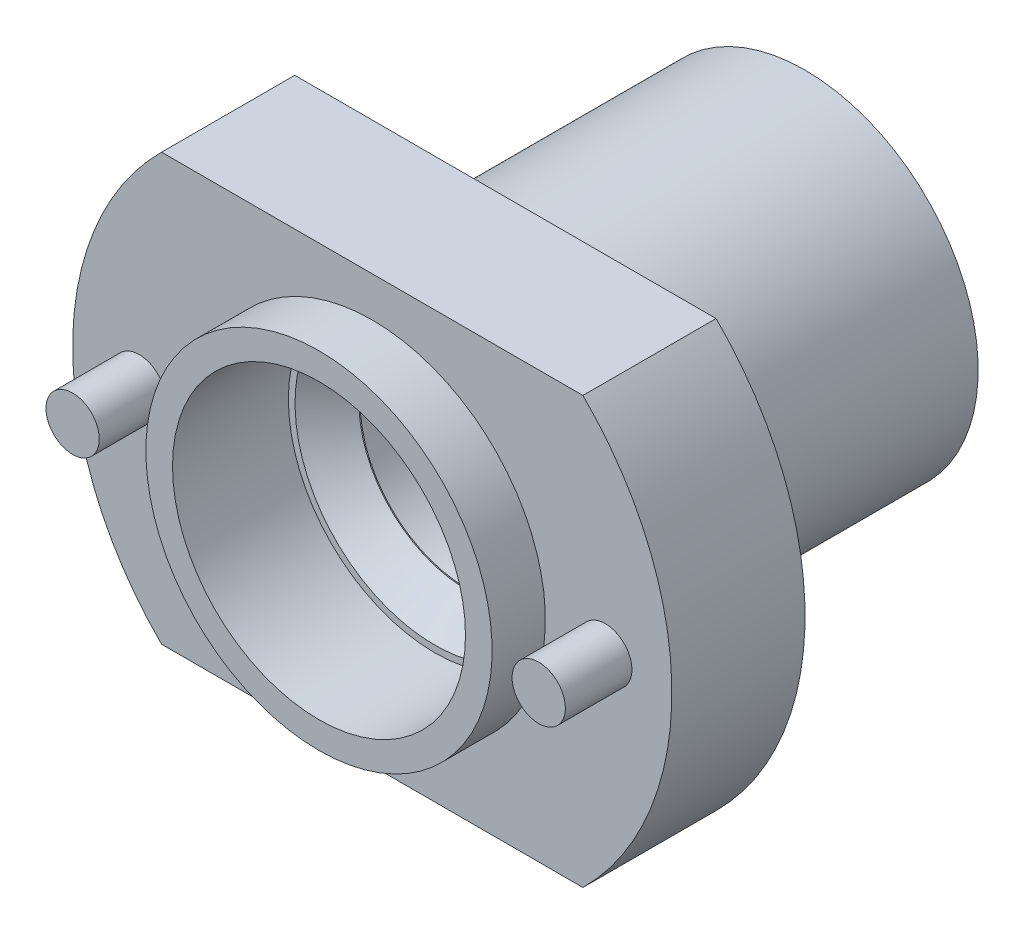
ISO-10303-21;
HEADER;
FILE_DESCRIPTION(('STEP AP214'),'2;1');
FILE_NAME('part.step','',(''),(''),'','','');
FILE_SCHEMA(('AUTOMOTIVE_DESIGN { 1 0 10303 214 1 1 1 1 }'));
ENDSEC;
DATA;
#1=APPLICATION_CONTEXT('core data for automotive mechanical design processes');
#2=APPLICATION_PROTOCOL_DEFINITION('international standard','automotive_design',2000,#1);
#3=PRODUCT_CONTEXT('',#1,'mechanical');
#4=PRODUCT('Part','Part','',(#3));
#5=PRODUCT_RELATED_PRODUCT_CATEGORY('part','',(#4));
#6=PRODUCT_DEFINITION_FORMATION('','',#4);
#7=PRODUCT_DEFINITION_CONTEXT('part definition',#1,'design');
#8=PRODUCT_DEFINITION('design','',#6,#7);
#9=PRODUCT_DEFINITION_SHAPE('','',#8);
#10=(LENGTH_UNIT() NAMED_UNIT(*) SI_UNIT(.MILLI.,.METRE.));
#11=(NAMED_UNIT(*) PLANE_ANGLE_UNIT() SI_UNIT($,.RADIAN.));
#12=(NAMED_UNIT(*) SI_UNIT($,.STERADIAN.) SOLID_ANGLE_UNIT());
#13=UNCERTAINTY_MEASURE_WITH_UNIT(LENGTH_MEASURE(1.E-05),#10,'distance_accuracy_value','');
#14=(GEOMETRIC_REPRESENTATION_CONTEXT(3) GLOBAL_UNCERTAINTY_ASSIGNED_CONTEXT((#13)) GLOBAL_UNIT_ASSIGNED_CONTEXT((#10,
#11,#12)) REPRESENTATION_CONTEXT('',''));
#15=CARTESIAN_POINT('',(0.,0.,0.));
#16=DIRECTION('',(0.,0.,1.));
#17=DIRECTION('',(1.,0.,0.));
#18=AXIS2_PLACEMENT_3D('',#15,#16,#17);
#19=CARTESIAN_POINT('',(0.,0.,-7.1));
#20=DIRECTION('',(0.,0.,1.));
#21=DIRECTION('',(0.,1.,0.));
#22=AXIS2_PLACEMENT_3D('',#19,#20,#21);
#23=CONICAL_SURFACE('',#22,8.1,0.785398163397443);
#24=CARTESIAN_POINT('',(0.,0.,-4.7));
#25=DIRECTION('',(0.,0.,1.));
#26=DIRECTION('',(0.,1.,0.));
#27=AXIS2_PLACEMENT_3D('',#24,#25,#26);
#28=CIRCLE('',#27,10.5);
#29=CARTESIAN_POINT('',(0.,10.5,-4.7));
#30=VERTEX_POINT('',#29);
#31=EDGE_CURVE('E24',#30,#30,#28,.T.);
#32=ORIENTED_EDGE('',*,*,#31,.T.);
#33=EDGE_LOOP('',(#32));
#34=FACE_BOUND('',#33,.T.);
#35=CARTESIAN_POINT('',(0.,0.,-7.1));
#36=DIRECTION('',(0.,0.,1.));
#37=DIRECTION('',(0.,1.,0.));
#38=AXIS2_PLACEMENT_3D('',#35,#36,#37);
#39=CIRCLE('',#38,8.1);
#40=CARTESIAN_POINT('',(0.,8.1,-7.1));
#41=VERTEX_POINT('',#40);
#42=EDGE_CURVE('E691',#41,#41,#39,.T.);
#43=ORIENTED_EDGE('',*,*,#42,.F.);
#44=EDGE_LOOP('',(#43));
#45=FACE_BOUND('',#44,.T.);
#46=ADVANCED_FACE('F14',(#34,#45),#23,.F.);
#47=CARTESIAN_POINT('',(-10.5,0.,-4.7));
#48=DIRECTION('',(0.,0.,1.));
#49=DIRECTION('',(0.,1.,0.));
#50=AXIS2_PLACEMENT_3D('',#47,#48,#49);
#51=PLANE('',#50);
#52=CARTESIAN_POINT('',(0.,0.,-4.7));
#53=DIRECTION('',(0.,0.,1.));
#54=DIRECTION('',(0.,1.,0.));
#55=AXIS2_PLACEMENT_3D('',#52,#53,#54);
#56=CIRCLE('',#55,11.);
#57=CARTESIAN_POINT('',(0.,11.,-4.7));
#58=VERTEX_POINT('',#57);
#59=EDGE_CURVE('E9',#58,#58,#56,.T.);
#60=ORIENTED_EDGE('',*,*,#59,.T.);
#61=EDGE_LOOP('',(#60));
#62=FACE_BOUND('',#61,.T.);
#63=ORIENTED_EDGE('',*,*,#31,.F.);
#64=EDGE_LOOP('',(#63));
#65=FACE_BOUND('',#64,.T.);
#66=ADVANCED_FACE('F287',(#62,#65),#51,.T.);
#67=CARTESIAN_POINT('',(0.,0.,-7.1));
#68=DIRECTION('',(0.,0.,-1.));
#69=DIRECTION('',(0.,-1.,0.));
#70=AXIS2_PLACEMENT_3D('',#67,#68,#69);
#71=PLANE('',#70);
#72=CARTESIAN_POINT('',(0.,0.,-7.1));
#73=DIRECTION('',(0.,0.,-1.));
#74=DIRECTION('',(0.,-1.,0.));
#75=AXIS2_PLACEMENT_3D('',#72,#73,#74);
#76=CIRCLE('',#75,8.);
#77=CARTESIAN_POINT('',(0.,-8.,-7.1));
#78=VERTEX_POINT('',#77);
#79=EDGE_CURVE('E688',#78,#78,#76,.T.);
#80=ORIENTED_EDGE('',*,*,#79,.T.);
#81=EDGE_LOOP('',(#80));
#82=FACE_BOUND('',#81,.T.);
#83=ORIENTED_EDGE('',*,*,#42,.T.);
#84=EDGE_LOOP('',(#83));
#85=FACE_BOUND('',#84,.T.);
#86=ADVANCED_FACE('F294',(#82,#85),#71,.F.);
#87=CARTESIAN_POINT('',(0.,0.,-7.1));
#88=DIRECTION('',(0.,0.,-1.));
#89=DIRECTION('',(0.,-1.,0.));
#90=AXIS2_PLACEMENT_3D('',#87,#88,#89);
#91=CYLINDRICAL_SURFACE('',#90,8.);
#92=ORIENTED_EDGE('',*,*,#79,.F.);
#93=EDGE_LOOP('',(#92));
#94=FACE_BOUND('',#93,.T.);
#95=CARTESIAN_POINT('',(0.,0.,-12.));
#96=DIRECTION('',(0.,0.,-1.));
#97=DIRECTION('',(0.,-1.,0.));
#98=AXIS2_PLACEMENT_3D('',#95,#96,#97);
#99=CIRCLE('',#98,8.);
#100=CARTESIAN_POINT('',(0.,-8.,-12.));
#101=VERTEX_POINT('',#100);
#102=EDGE_CURVE('E127',#101,#101,#99,.T.);
#103=ORIENTED_EDGE('',*,*,#102,.T.);
#104=EDGE_LOOP('',(#103));
#105=FACE_BOUND('',#104,.T.);
#106=ADVANCED_FACE('F344',(#94,#105),#91,.F.);
#107=CARTESIAN_POINT('',(-17.5,0.,-6.5));
#108=DIRECTION('',(0.,0.,-1.));
#109=DIRECTION('',(0.,-1.,0.));
#110=AXIS2_PLACEMENT_3D('',#107,#108,#109);
#111=PLANE('',#110);
#112=DIRECTION('',(0.866025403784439,0.5,0.));
#113=VECTOR('',#112,1.);
#114=CARTESIAN_POINT('',(-19.,0.866025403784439,-6.5));
#115=LINE('',#114,#113);
#116=CARTESIAN_POINT('',(-19.,0.866025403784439,-6.5));
#117=VERTEX_POINT('',#116);
#118=CARTESIAN_POINT('',(-17.5,1.73205080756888,-6.5));
#119=VERTEX_POINT('',#118);
#120=EDGE_CURVE('E182',#117,#119,#115,.T.);
#121=ORIENTED_EDGE('',*,*,#120,.T.);
#122=DIRECTION('',(0.866025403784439,-0.5,0.));
#123=VECTOR('',#122,1.);
#124=CARTESIAN_POINT('',(-17.5,1.73205080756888,-6.5));
#125=LINE('',#124,#123);
#126=CARTESIAN_POINT('',(-16.,0.866025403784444,-6.5));
#127=VERTEX_POINT('',#126);
#128=EDGE_CURVE('E185',#119,#127,#125,.T.);
#129=ORIENTED_EDGE('',*,*,#128,.T.);
#130=DIRECTION('',(0.,-1.,0.));
#131=VECTOR('',#130,1.);
#132=CARTESIAN_POINT('',(-16.,0.866025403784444,-6.5));
#133=LINE('',#132,#131);
#134=CARTESIAN_POINT('',(-16.,-0.866025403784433,-6.5));
#135=VERTEX_POINT('',#134);
#136=EDGE_CURVE('E189',#127,#135,#133,.T.);
#137=ORIENTED_EDGE('',*,*,#136,.T.);
#138=DIRECTION('',(-0.866025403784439,-0.5,0.));
#139=VECTOR('',#138,1.);
#140=CARTESIAN_POINT('',(-16.,-0.866025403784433,-6.5));
#141=LINE('',#140,#139);
#142=CARTESIAN_POINT('',(-17.5,-1.73205080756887,-6.5));
#143=VERTEX_POINT('',#142);
#144=EDGE_CURVE('E192',#135,#143,#141,.T.);
#145=ORIENTED_EDGE('',*,*,#144,.T.);
#146=DIRECTION('',(-0.866025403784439,0.5,0.));
#147=VECTOR('',#146,1.);
#148=CARTESIAN_POINT('',(-17.5,-1.73205080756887,-6.5));
#149=LINE('',#148,#147);
#150=CARTESIAN_POINT('',(-19.,-0.866025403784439,-6.5));
#151=VERTEX_POINT('',#150);
#152=EDGE_CURVE('E195',#143,#151,#149,.T.);
#153=ORIENTED_EDGE('',*,*,#152,.T.);
#154=DIRECTION('',(0.,1.,0.));
#155=VECTOR('',#154,1.);
#156=CARTESIAN_POINT('',(-19.,-0.866025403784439,-6.5));
#157=LINE('',#156,#155);
#158=EDGE_CURVE('E198',#151,#117,#157,.T.);
#159=ORIENTED_EDGE('',*,*,#158,.T.);
#160=EDGE_LOOP('',(#121,#129,#137,#145,#153,#159));
#161=FACE_BOUND('',#160,.T.);
#162=ADVANCED_FACE('F306',(#161),#111,.T.);
#163=CARTESIAN_POINT('',(17.5,1.2220184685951E-13,-6.5));
#164=DIRECTION('',(0.,0.,-1.));
#165=DIRECTION('',(0.,1.,0.));
#166=AXIS2_PLACEMENT_3D('',#163,#164,#165);
#167=PLANE('',#166);
#168=DIRECTION('',(-0.866025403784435,-0.500000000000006,0.));
#169=VECTOR('',#168,1.);
#170=CARTESIAN_POINT('',(19.,-0.866025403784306,-6.5));
#171=LINE('',#170,#169);
#172=CARTESIAN_POINT('',(19.,-0.866025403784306,-6.5));
#173=VERTEX_POINT('',#172);
#174=CARTESIAN_POINT('',(17.5,-1.73205080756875,-6.5));
#175=VERTEX_POINT('',#174);
#176=EDGE_CURVE('E704',#173,#175,#171,.T.);
#177=ORIENTED_EDGE('',*,*,#176,.T.);
#178=DIRECTION('',(-0.866025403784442,0.499999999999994,0.));
#179=VECTOR('',#178,1.);
#180=CARTESIAN_POINT('',(17.5,-1.73205080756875,-6.5));
#181=LINE('',#180,#179);
#182=CARTESIAN_POINT('',(16.,-0.866025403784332,-6.5));
#183=VERTEX_POINT('',#182);
#184=EDGE_CURVE('E707',#175,#183,#181,.T.);
#185=ORIENTED_EDGE('',*,*,#184,.T.);
#186=DIRECTION('',(0.,1.,0.));
#187=VECTOR('',#186,1.);
#188=CARTESIAN_POINT('',(16.,-0.866025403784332,-6.5));
#189=LINE('',#188,#187);
#190=CARTESIAN_POINT('',(16.,0.866025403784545,-6.5));
#191=VERTEX_POINT('',#190);
#192=EDGE_CURVE('E711',#183,#191,#189,.T.);
#193=ORIENTED_EDGE('',*,*,#192,.T.);
#194=DIRECTION('',(0.866025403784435,0.500000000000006,0.));
#195=VECTOR('',#194,1.);
#196=CARTESIAN_POINT('',(16.,0.866025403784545,-6.5));
#197=LINE('',#196,#195);
#198=CARTESIAN_POINT('',(17.5,1.732050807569,-6.5));
#199=VERTEX_POINT('',#198);
#200=EDGE_CURVE('E714',#191,#199,#197,.T.);
#201=ORIENTED_EDGE('',*,*,#200,.T.);
#202=DIRECTION('',(0.866025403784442,-0.499999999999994,0.));
#203=VECTOR('',#202,1.);
#204=CARTESIAN_POINT('',(17.5,1.732050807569,-6.5));
#205=LINE('',#204,#203);
#206=CARTESIAN_POINT('',(19.,0.866025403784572,-6.5));
#207=VERTEX_POINT('',#206);
#208=EDGE_CURVE('E717',#199,#207,#205,.T.);
#209=ORIENTED_EDGE('',*,*,#208,.T.);
#210=DIRECTION('',(0.,-1.,0.));
#211=VECTOR('',#210,1.);
#212=CARTESIAN_POINT('',(19.,0.866025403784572,-6.5));
#213=LINE('',#212,#211);
#214=EDGE_CURVE('E720',#207,#173,#213,.T.);
#215=ORIENTED_EDGE('',*,*,#214,.T.);
#216=EDGE_LOOP('',(#177,#185,#193,#201,#209,#215));
#217=FACE_BOUND('',#216,.T.);
#218=ADVANCED_FACE('F302',(#217),#167,.T.);
#219=CARTESIAN_POINT('',(-17.5,1.73205080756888,-6.5));
#220=DIRECTION('',(0.5,0.866025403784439,0.));
#221=DIRECTION('',(0.866025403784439,-0.5,0.));
#222=AXIS2_PLACEMENT_3D('',#219,#220,#221);
#223=PLANE('',#222);
#224=DIRECTION('',(0.866025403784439,-0.5,0.));
#225=VECTOR('',#224,1.);
#226=CARTESIAN_POINT('',(-17.5,1.73205080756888,-9.));
#227=LINE('',#226,#225);
#228=CARTESIAN_POINT('',(-17.5,1.73205080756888,-9.));
#229=VERTEX_POINT('',#228);
#230=CARTESIAN_POINT('',(-16.,0.866025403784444,-9.));
#231=VERTEX_POINT('',#230);
#232=EDGE_CURVE('E203',#229,#231,#227,.T.);
#233=ORIENTED_EDGE('',*,*,#232,.T.);
#234=DIRECTION('',(0.,0.,-1.));
#235=VECTOR('',#234,1.);
#236=CARTESIAN_POINT('',(-16.,0.866025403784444,-6.5));
#237=LINE('',#236,#235);
#238=EDGE_CURVE('E226',#127,#231,#237,.T.);
#239=ORIENTED_EDGE('',*,*,#238,.F.);
#240=ORIENTED_EDGE('',*,*,#128,.F.);
#241=DIRECTION('',(0.,0.,-1.));
#242=VECTOR('',#241,1.);
#243=CARTESIAN_POINT('',(-17.5,1.73205080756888,-6.5));
#244=LINE('',#243,#242);
#245=EDGE_CURVE('E201',#119,#229,#244,.T.);
#246=ORIENTED_EDGE('',*,*,#245,.T.);
#247=EDGE_LOOP('',(#233,#239,#240,#246));
#248=FACE_BOUND('',#247,.T.);
#249=ADVANCED_FACE('F305',(#248),#223,.F.);
#250=CARTESIAN_POINT('',(-16.,0.866025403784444,-6.5));
#251=DIRECTION('',(1.,0.,0.));
#252=DIRECTION('',(0.,-1.,0.));
#253=AXIS2_PLACEMENT_3D('',#250,#251,#252);
#254=PLANE('',#253);
#255=DIRECTION('',(0.,-1.,0.));
#256=VECTOR('',#255,1.);
#257=CARTESIAN_POINT('',(-16.,0.866025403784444,-9.));
#258=LINE('',#257,#256);
#259=CARTESIAN_POINT('',(-16.,-0.866025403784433,-9.));
#260=VERTEX_POINT('',#259);
#261=EDGE_CURVE('E206',#231,#260,#258,.T.);
#262=ORIENTED_EDGE('',*,*,#261,.T.);
#263=DIRECTION('',(0.,0.,-1.));
#264=VECTOR('',#263,1.);
#265=CARTESIAN_POINT('',(-16.,-0.866025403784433,-6.5));
#266=LINE('',#265,#264);
#267=EDGE_CURVE('E224',#135,#260,#266,.T.);
#268=ORIENTED_EDGE('',*,*,#267,.F.);
#269=ORIENTED_EDGE('',*,*,#136,.F.);
#270=ORIENTED_EDGE('',*,*,#238,.T.);
#271=EDGE_LOOP('',(#262,#268,#269,#270));
#272=FACE_BOUND('',#271,.T.);
#273=ADVANCED_FACE('F359',(#272),#254,.F.);
#274=CARTESIAN_POINT('',(-16.,-0.866025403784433,-6.5));
#275=DIRECTION('',(0.5,-0.866025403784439,0.));
#276=DIRECTION('',(-0.866025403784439,-0.5,0.));
#277=AXIS2_PLACEMENT_3D('',#274,#275,#276);
#278=PLANE('',#277);
#279=DIRECTION('',(-0.866025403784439,-0.5,0.));
#280=VECTOR('',#279,1.);
#281=CARTESIAN_POINT('',(-16.,-0.866025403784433,-9.));
#282=LINE('',#281,#280);
#283=CARTESIAN_POINT('',(-17.5,-1.73205080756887,-9.));
#284=VERTEX_POINT('',#283);
#285=EDGE_CURVE('E209',#260,#284,#282,.T.);
#286=ORIENTED_EDGE('',*,*,#285,.T.);
#287=DIRECTION('',(0.,0.,-1.));
#288=VECTOR('',#287,1.);
#289=CARTESIAN_POINT('',(-17.5,-1.73205080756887,-6.5));
#290=LINE('',#289,#288);
#291=EDGE_CURVE('E222',#143,#284,#290,.T.);
#292=ORIENTED_EDGE('',*,*,#291,.F.);
#293=ORIENTED_EDGE('',*,*,#144,.F.);
#294=ORIENTED_EDGE('',*,*,#267,.T.);
#295=EDGE_LOOP('',(#286,#292,#293,#294));
#296=FACE_BOUND('',#295,.T.);
#297=ADVANCED_FACE('F355',(#296),#278,.F.);
#298=CARTESIAN_POINT('',(-17.5,-1.73205080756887,-6.5));
#299=DIRECTION('',(-0.5,-0.866025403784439,0.));
#300=DIRECTION('',(-0.866025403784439,0.5,0.));
#301=AXIS2_PLACEMENT_3D('',#298,#299,#300);
#302=PLANE('',#301);
#303=DIRECTION('',(-0.866025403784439,0.5,0.));
#304=VECTOR('',#303,1.);
#305=CARTESIAN_POINT('',(-17.5,-1.73205080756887,-9.));
#306=LINE('',#305,#304);
#307=CARTESIAN_POINT('',(-19.,-0.866025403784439,-9.));
#308=VERTEX_POINT('',#307);
#309=EDGE_CURVE('E212',#284,#308,#306,.T.);
#310=ORIENTED_EDGE('',*,*,#309,.T.);
#311=DIRECTION('',(0.,0.,-1.));
#312=VECTOR('',#311,1.);
#313=CARTESIAN_POINT('',(-19.,-0.866025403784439,-6.5));
#314=LINE('',#313,#312);
#315=EDGE_CURVE('E220',#151,#308,#314,.T.);
#316=ORIENTED_EDGE('',*,*,#315,.F.);
#317=ORIENTED_EDGE('',*,*,#152,.F.);
#318=ORIENTED_EDGE('',*,*,#291,.T.);
#319=EDGE_LOOP('',(#310,#316,#317,#318));
#320=FACE_BOUND('',#319,.T.);
#321=ADVANCED_FACE('F351',(#320),#302,.F.);
#322=CARTESIAN_POINT('',(-19.,-0.866025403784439,-6.5));
#323=DIRECTION('',(-1.,0.,0.));
#324=DIRECTION('',(0.,1.,0.));
#325=AXIS2_PLACEMENT_3D('',#322,#323,#324);
#326=PLANE('',#325);
#327=DIRECTION('',(0.,1.,0.));
#328=VECTOR('',#327,1.);
#329=CARTESIAN_POINT('',(-19.,-0.866025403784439,-9.));
#330=LINE('',#329,#328);
#331=CARTESIAN_POINT('',(-19.,0.866025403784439,-9.));
#332=VERTEX_POINT('',#331);
#333=EDGE_CURVE('E186',#308,#332,#330,.T.);
#334=ORIENTED_EDGE('',*,*,#333,.T.);
#335=DIRECTION('',(0.,0.,-1.));
#336=VECTOR('',#335,1.);
#337=CARTESIAN_POINT('',(-19.,0.866025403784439,-6.5));
#338=LINE('',#337,#336);
#339=EDGE_CURVE('E217',#117,#332,#338,.T.);
#340=ORIENTED_EDGE('',*,*,#339,.F.);
#341=ORIENTED_EDGE('',*,*,#158,.F.);
#342=ORIENTED_EDGE('',*,*,#315,.T.);
#343=EDGE_LOOP('',(#334,#340,#341,#342));
#344=FACE_BOUND('',#343,.T.);
#345=ADVANCED_FACE('F348',(#344),#326,.F.);
#346=CARTESIAN_POINT('',(-19.,0.866025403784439,-6.5));
#347=DIRECTION('',(-0.5,0.866025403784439,0.));
#348=DIRECTION('',(0.866025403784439,0.5,0.));
#349=AXIS2_PLACEMENT_3D('',#346,#347,#348);
#350=PLANE('',#349);
#351=DIRECTION('',(0.866025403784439,0.5,0.));
#352=VECTOR('',#351,1.);
#353=CARTESIAN_POINT('',(-19.,0.866025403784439,-9.));
#354=LINE('',#353,#352);
#355=EDGE_CURVE('E176',#332,#229,#354,.T.);
#356=ORIENTED_EDGE('',*,*,#355,.T.);
#357=ORIENTED_EDGE('',*,*,#245,.F.);
#358=ORIENTED_EDGE('',*,*,#120,.F.);
#359=ORIENTED_EDGE('',*,*,#339,.T.);
#360=EDGE_LOOP('',(#356,#357,#358,#359));
#361=FACE_BOUND('',#360,.T.);
#362=ADVANCED_FACE('F328',(#361),#350,.F.);
#363=CARTESIAN_POINT('',(17.5,-1.73205080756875,-6.5));
#364=DIRECTION('',(-0.499999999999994,-0.866025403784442,0.));
#365=DIRECTION('',(-0.866025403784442,0.499999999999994,0.));
#366=AXIS2_PLACEMENT_3D('',#363,#364,#365);
#367=PLANE('',#366);
#368=DIRECTION('',(-0.866025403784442,0.499999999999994,0.));
#369=VECTOR('',#368,1.);
#370=CARTESIAN_POINT('',(17.5,-1.73205080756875,-9.));
#371=LINE('',#370,#369);
#372=CARTESIAN_POINT('',(17.5,-1.73205080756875,-9.));
#373=VERTEX_POINT('',#372);
#374=CARTESIAN_POINT('',(16.,-0.866025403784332,-9.));
#375=VERTEX_POINT('',#374);
#376=EDGE_CURVE('E725',#373,#375,#371,.T.);
#377=ORIENTED_EDGE('',*,*,#376,.T.);
#378=DIRECTION('',(0.,0.,-1.));
#379=VECTOR('',#378,1.);
#380=CARTESIAN_POINT('',(16.,-0.866025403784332,-6.5));
#381=LINE('',#380,#379);
#382=EDGE_CURVE('E750',#183,#375,#381,.T.);
#383=ORIENTED_EDGE('',*,*,#382,.F.);
#384=ORIENTED_EDGE('',*,*,#184,.F.);
#385=DIRECTION('',(0.,0.,-1.));
#386=VECTOR('',#385,1.);
#387=CARTESIAN_POINT('',(17.5,-1.73205080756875,-6.5));
#388=LINE('',#387,#386);
#389=EDGE_CURVE('E723',#175,#373,#388,.T.);
#390=ORIENTED_EDGE('',*,*,#389,.T.);
#391=EDGE_LOOP('',(#377,#383,#384,#390));
#392=FACE_BOUND('',#391,.T.);
#393=ADVANCED_FACE('F308',(#392),#367,.F.);
#394=CARTESIAN_POINT('',(16.,-0.866025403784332,-6.5));
#395=DIRECTION('',(-1.,0.,0.));
#396=DIRECTION('',(0.,1.,0.));
#397=AXIS2_PLACEMENT_3D('',#394,#395,#396);
#398=PLANE('',#397);
#399=DIRECTION('',(0.,1.,0.));
#400=VECTOR('',#399,1.);
#401=CARTESIAN_POINT('',(16.,-0.866025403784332,-9.));
#402=LINE('',#401,#400);
#403=CARTESIAN_POINT('',(16.,0.866025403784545,-9.));
#404=VERTEX_POINT('',#403);
#405=EDGE_CURVE('E728',#375,#404,#402,.T.);
#406=ORIENTED_EDGE('',*,*,#405,.T.);
#407=DIRECTION('',(0.,0.,-1.));
#408=VECTOR('',#407,1.);
#409=CARTESIAN_POINT('',(16.,0.866025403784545,-6.5));
#410=LINE('',#409,#408);
#411=EDGE_CURVE('E747',#191,#404,#410,.T.);
#412=ORIENTED_EDGE('',*,*,#411,.F.);
#413=ORIENTED_EDGE('',*,*,#192,.F.);
#414=ORIENTED_EDGE('',*,*,#382,.T.);
#415=EDGE_LOOP('',(#406,#412,#413,#414));
#416=FACE_BOUND('',#415,.T.);
#417=ADVANCED_FACE('F321',(#416),#398,.F.);
#418=CARTESIAN_POINT('',(16.,0.866025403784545,-6.5));
#419=DIRECTION('',(-0.500000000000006,0.866025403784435,0.));
#420=DIRECTION('',(0.866025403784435,0.500000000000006,0.));
#421=AXIS2_PLACEMENT_3D('',#418,#419,#420);
#422=PLANE('',#421);
#423=DIRECTION('',(0.866025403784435,0.500000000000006,0.));
#424=VECTOR('',#423,1.);
#425=CARTESIAN_POINT('',(16.,0.866025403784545,-9.));
#426=LINE('',#425,#424);
#427=CARTESIAN_POINT('',(17.5,1.732050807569,-9.));
#428=VERTEX_POINT('',#427);
#429=EDGE_CURVE('E731',#404,#428,#426,.T.);
#430=ORIENTED_EDGE('',*,*,#429,.T.);
#431=DIRECTION('',(0.,0.,-1.));
#432=VECTOR('',#431,1.);
#433=CARTESIAN_POINT('',(17.5,1.732050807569,-6.5));
#434=LINE('',#433,#432);
#435=EDGE_CURVE('E744',#199,#428,#434,.T.);
#436=ORIENTED_EDGE('',*,*,#435,.F.);
#437=ORIENTED_EDGE('',*,*,#200,.F.);
#438=ORIENTED_EDGE('',*,*,#411,.T.);
#439=EDGE_LOOP('',(#430,#436,#437,#438));
#440=FACE_BOUND('',#439,.T.);
#441=ADVANCED_FACE('F317',(#440),#422,.F.);
#442=CARTESIAN_POINT('',(17.5,1.732050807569,-6.5));
#443=DIRECTION('',(0.499999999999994,0.866025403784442,0.));
#444=DIRECTION('',(0.866025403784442,-0.499999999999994,0.));
#445=AXIS2_PLACEMENT_3D('',#442,#443,#444);
#446=PLANE('',#445);
#447=DIRECTION('',(0.866025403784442,-0.499999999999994,0.));
#448=VECTOR('',#447,1.);
#449=CARTESIAN_POINT('',(17.5,1.732050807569,-9.));
#450=LINE('',#449,#448);
#451=CARTESIAN_POINT('',(19.,0.866025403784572,-9.));
#452=VERTEX_POINT('',#451);
#453=EDGE_CURVE('E734',#428,#452,#450,.T.);
#454=ORIENTED_EDGE('',*,*,#453,.T.);
#455=DIRECTION('',(0.,0.,-1.));
#456=VECTOR('',#455,1.);
#457=CARTESIAN_POINT('',(19.,0.866025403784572,-6.5));
#458=LINE('',#457,#456);
#459=EDGE_CURVE('E741',#207,#452,#458,.T.);
#460=ORIENTED_EDGE('',*,*,#459,.F.);
#461=ORIENTED_EDGE('',*,*,#208,.F.);
#462=ORIENTED_EDGE('',*,*,#435,.T.);
#463=EDGE_LOOP('',(#454,#460,#461,#462));
#464=FACE_BOUND('',#463,.T.);
#465=ADVANCED_FACE('F313',(#464),#446,.F.);
#466=CARTESIAN_POINT('',(19.,0.866025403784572,-6.5));
#467=DIRECTION('',(1.,0.,0.));
#468=DIRECTION('',(0.,-1.,0.));
#469=AXIS2_PLACEMENT_3D('',#466,#467,#468);
#470=PLANE('',#469);
#471=DIRECTION('',(0.,-1.,0.));
#472=VECTOR('',#471,1.);
#473=CARTESIAN_POINT('',(19.,0.866025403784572,-9.));
#474=LINE('',#473,#472);
#475=CARTESIAN_POINT('',(19.,-0.866025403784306,-9.));
#476=VERTEX_POINT('',#475);
#477=EDGE_CURVE('E708',#452,#476,#474,.T.);
#478=ORIENTED_EDGE('',*,*,#477,.T.);
#479=DIRECTION('',(0.,0.,-1.));
#480=VECTOR('',#479,1.);
#481=CARTESIAN_POINT('',(19.,-0.866025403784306,-6.5));
#482=LINE('',#481,#480);
#483=EDGE_CURVE('E739',#173,#476,#482,.T.);
#484=ORIENTED_EDGE('',*,*,#483,.F.);
#485=ORIENTED_EDGE('',*,*,#214,.F.);
#486=ORIENTED_EDGE('',*,*,#459,.T.);
#487=EDGE_LOOP('',(#478,#484,#485,#486));
#488=FACE_BOUND('',#487,.T.);
#489=ADVANCED_FACE('F309',(#488),#470,.F.);
#490=CARTESIAN_POINT('',(19.,-0.866025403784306,-6.5));
#491=DIRECTION('',(0.500000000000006,-0.866025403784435,0.));
#492=DIRECTION('',(-0.866025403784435,-0.500000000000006,0.));
#493=AXIS2_PLACEMENT_3D('',#490,#491,#492);
#494=PLANE('',#493);
#495=DIRECTION('',(-0.866025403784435,-0.500000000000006,0.));
#496=VECTOR('',#495,1.);
#497=CARTESIAN_POINT('',(19.,-0.866025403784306,-9.));
#498=LINE('',#497,#496);
#499=EDGE_CURVE('E33',#476,#373,#498,.T.);
#500=ORIENTED_EDGE('',*,*,#499,.T.);
#501=ORIENTED_EDGE('',*,*,#389,.F.);
#502=ORIENTED_EDGE('',*,*,#176,.F.);
#503=ORIENTED_EDGE('',*,*,#483,.T.);
#504=EDGE_LOOP('',(#500,#501,#502,#503));
#505=FACE_BOUND('',#504,.T.);
#506=ADVANCED_FACE('F312',(#505),#494,.F.);
#507=CARTESIAN_POINT('',(-17.5,0.,-9.));
#508=DIRECTION('',(0.,0.,-1.));
#509=DIRECTION('',(0.,-1.,0.));
#510=AXIS2_PLACEMENT_3D('',#507,#508,#509);
#511=PLANE('',#510);
#512=ORIENTED_EDGE('',*,*,#355,.F.);
#513=ORIENTED_EDGE('',*,*,#333,.F.);
#514=ORIENTED_EDGE('',*,*,#309,.F.);
#515=ORIENTED_EDGE('',*,*,#285,.F.);
#516=ORIENTED_EDGE('',*,*,#261,.F.);
#517=ORIENTED_EDGE('',*,*,#232,.F.);
#518=EDGE_LOOP('',(#512,#513,#514,#515,#516,#517));
#519=FACE_BOUND('',#518,.T.);
#520=CARTESIAN_POINT('',(-17.5,0.,-9.));
#521=DIRECTION('',(0.,0.,-1.));
#522=DIRECTION('',(0.,-1.,0.));
#523=AXIS2_PLACEMENT_3D('',#520,#521,#522);
#524=CIRCLE('',#523,3.5);
#525=CARTESIAN_POINT('',(-17.5,-3.5,-9.));
#526=VERTEX_POINT('',#525);
#527=EDGE_CURVE('E171',#526,#526,#524,.T.);
#528=ORIENTED_EDGE('',*,*,#527,.T.);
#529=EDGE_LOOP('',(#528));
#530=FACE_BOUND('',#529,.T.);
#531=ADVANCED_FACE('F332',(#519,#530),#511,.T.);
#532=CARTESIAN_POINT('',(17.5,1.2220184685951E-13,-9.));
#533=DIRECTION('',(0.,0.,-1.));
#534=DIRECTION('',(0.,1.,0.));
#535=AXIS2_PLACEMENT_3D('',#532,#533,#534);
#536=PLANE('',#535);
#537=ORIENTED_EDGE('',*,*,#499,.F.);
#538=ORIENTED_EDGE('',*,*,#477,.F.);
#539=ORIENTED_EDGE('',*,*,#453,.F.);
#540=ORIENTED_EDGE('',*,*,#429,.F.);
#541=ORIENTED_EDGE('',*,*,#405,.F.);
#542=ORIENTED_EDGE('',*,*,#376,.F.);
#543=EDGE_LOOP('',(#537,#538,#539,#540,#541,#542));
#544=FACE_BOUND('',#543,.T.);
#545=CARTESIAN_POINT('',(17.5,1.2220184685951E-13,-9.));
#546=DIRECTION('',(0.,0.,-1.));
#547=DIRECTION('',(0.,1.,0.));
#548=AXIS2_PLACEMENT_3D('',#545,#546,#547);
#549=CIRCLE('',#548,3.5);
#550=CARTESIAN_POINT('',(17.5,3.50000000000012,-9.));
#551=VERTEX_POINT('',#550);
#552=EDGE_CURVE('E701',#551,#551,#549,.T.);
#553=ORIENTED_EDGE('',*,*,#552,.T.);
#554=EDGE_LOOP('',(#553));
#555=FACE_BOUND('',#554,.T.);
#556=ADVANCED_FACE('F275',(#544,#555),#536,.T.);
#557=CARTESIAN_POINT('',(-17.5,0.,-5.));
#558=DIRECTION('',(0.,0.,1.));
#559=DIRECTION('',(0.,1.,0.));
#560=AXIS2_PLACEMENT_3D('',#557,#558,#559);
#561=CYLINDRICAL_SURFACE('',#560,3.5);
#562=ORIENTED_EDGE('',*,*,#527,.F.);
#563=EDGE_LOOP('',(#562));
#564=FACE_BOUND('',#563,.T.);
#565=CARTESIAN_POINT('',(-17.5,0.,-5.));
#566=DIRECTION('',(0.,0.,1.));
#567=DIRECTION('',(0.,1.,0.));
#568=AXIS2_PLACEMENT_3D('',#565,#566,#567);
#569=CIRCLE('',#568,3.5);
#570=CARTESIAN_POINT('',(-17.5,3.5,-5.));
#571=VERTEX_POINT('',#570);
#572=EDGE_CURVE('E219',#571,#571,#569,.T.);
#573=ORIENTED_EDGE('',*,*,#572,.F.);
#574=EDGE_LOOP('',(#573));
#575=FACE_BOUND('',#574,.T.);
#576=ADVANCED_FACE('F272',(#564,#575),#561,.T.);
#577=CARTESIAN_POINT('',(17.5,1.2220184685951E-13,-5.));
#578=DIRECTION('',(0.,0.,1.));
#579=DIRECTION('',(0.,-1.,0.));
#580=AXIS2_PLACEMENT_3D('',#577,#578,#579);
#581=CYLINDRICAL_SURFACE('',#580,3.5);
#582=ORIENTED_EDGE('',*,*,#552,.F.);
#583=EDGE_LOOP('',(#582));
#584=FACE_BOUND('',#583,.T.);
#585=CARTESIAN_POINT('',(17.5,1.2220184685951E-13,-5.));
#586=DIRECTION('',(0.,0.,1.));
#587=DIRECTION('',(0.,-1.,0.));
#588=AXIS2_PLACEMENT_3D('',#585,#586,#587);
#589=CIRCLE('',#588,3.5);
#590=CARTESIAN_POINT('',(17.5,-3.49999999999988,-5.));
#591=VERTEX_POINT('',#590);
#592=EDGE_CURVE('E696',#591,#591,#589,.T.);
#593=ORIENTED_EDGE('',*,*,#592,.F.);
#594=EDGE_LOOP('',(#593));
#595=FACE_BOUND('',#594,.T.);
#596=ADVANCED_FACE('F257',(#584,#595),#581,.T.);
#597=CARTESIAN_POINT('',(-17.5,0.,-5.));
#598=DIRECTION('',(0.,0.,1.));
#599=DIRECTION('',(0.,1.,0.));
#600=AXIS2_PLACEMENT_3D('',#597,#598,#599);
#601=PLANE('',#600);
#602=ORIENTED_EDGE('',*,*,#572,.T.);
#603=EDGE_LOOP('',(#602));
#604=FACE_BOUND('',#603,.T.);
#605=CARTESIAN_POINT('',(-17.5,0.,-5.));
#606=DIRECTION('',(0.,0.,1.));
#607=DIRECTION('',(0.,1.,0.));
#608=AXIS2_PLACEMENT_3D('',#605,#606,#607);
#609=CIRCLE('',#608,4.);
#610=CARTESIAN_POINT('',(-17.5,4.,-5.));
#611=VERTEX_POINT('',#610);
#612=EDGE_CURVE('E151',#611,#611,#609,.T.);
#613=ORIENTED_EDGE('',*,*,#612,.F.);
#614=EDGE_LOOP('',(#613));
#615=FACE_BOUND('',#614,.T.);
#616=ADVANCED_FACE('F254',(#604,#615),#601,.F.);
#617=CARTESIAN_POINT('',(17.5,0.,-5.));
#618=DIRECTION('',(0.,0.,1.));
#619=DIRECTION('',(0.,1.,0.));
#620=AXIS2_PLACEMENT_3D('',#617,#618,#619);
#621=PLANE('',#620);
#622=ORIENTED_EDGE('',*,*,#592,.T.);
#623=EDGE_LOOP('',(#622));
#624=FACE_BOUND('',#623,.T.);
#625=CARTESIAN_POINT('',(17.5,0.,-5.));
#626=DIRECTION('',(0.,0.,-1.));
#627=DIRECTION('',(0.,1.,0.));
#628=AXIS2_PLACEMENT_3D('',#625,#626,#627);
#629=CIRCLE('',#628,4.);
#630=CARTESIAN_POINT('',(17.5,4.,-5.));
#631=VERTEX_POINT('',#630);
#632=EDGE_CURVE('E155',#631,#631,#629,.T.);
#633=ORIENTED_EDGE('',*,*,#632,.T.);
#634=EDGE_LOOP('',(#633));
#635=FACE_BOUND('',#634,.T.);
#636=ADVANCED_FACE('F256',(#624,#635),#621,.F.);
#637=CARTESIAN_POINT('',(-17.5,0.,-25.));
#638=DIRECTION('',(0.,0.,1.));
#639=DIRECTION('',(0.,1.,0.));
#640=AXIS2_PLACEMENT_3D('',#637,#638,#639);
#641=CYLINDRICAL_SURFACE('',#640,4.);
#642=ORIENTED_EDGE('',*,*,#612,.T.);
#643=EDGE_LOOP('',(#642));
#644=FACE_BOUND('',#643,.T.);
#645=CARTESIAN_POINT('',(-17.5,0.,-10.));
#646=DIRECTION('',(0.,0.,1.));
#647=DIRECTION('',(0.,1.,0.));
#648=AXIS2_PLACEMENT_3D('',#645,#646,#647);
#649=CIRCLE('',#648,4.);
#650=CARTESIAN_POINT('',(-17.5,4.,-10.));
#651=VERTEX_POINT('',#650);
#652=EDGE_CURVE('E147',#651,#651,#649,.T.);
#653=ORIENTED_EDGE('',*,*,#652,.F.);
#654=EDGE_LOOP('',(#653));
#655=FACE_BOUND('',#654,.T.);
#656=ADVANCED_FACE('F251',(#644,#655),#641,.F.);
#657=CARTESIAN_POINT('',(17.5,0.,-25.));
#658=DIRECTION('',(0.,0.,1.));
#659=DIRECTION('',(0.,1.,0.));
#660=AXIS2_PLACEMENT_3D('',#657,#658,#659);
#661=CYLINDRICAL_SURFACE('',#660,4.);
#662=ORIENTED_EDGE('',*,*,#632,.F.);
#663=EDGE_LOOP('',(#662));
#664=FACE_BOUND('',#663,.T.);
#665=CARTESIAN_POINT('',(17.5,0.,-10.));
#666=DIRECTION('',(0.,0.,1.));
#667=DIRECTION('',(0.,1.,0.));
#668=AXIS2_PLACEMENT_3D('',#665,#666,#667);
#669=CIRCLE('',#668,4.);
#670=CARTESIAN_POINT('',(17.5,4.,-10.));
#671=VERTEX_POINT('',#670);
#672=EDGE_CURVE('E152',#671,#671,#669,.F.);
#673=ORIENTED_EDGE('',*,*,#672,.T.);
#674=EDGE_LOOP('',(#673));
#675=FACE_BOUND('',#674,.T.);
#676=ADVANCED_FACE('F270',(#664,#675),#661,.F.);
#677=CARTESIAN_POINT('',(-13.,0.,-10.));
#678=DIRECTION('',(0.,0.,1.));
#679=DIRECTION('',(0.,1.,0.));
#680=AXIS2_PLACEMENT_3D('',#677,#678,#679);
#681=PLANE('',#680);
#682=ORIENTED_EDGE('',*,*,#672,.F.);
#683=EDGE_LOOP('',(#682));
#684=FACE_BOUND('',#683,.T.);
#685=ORIENTED_EDGE('',*,*,#652,.T.);
#686=EDGE_LOOP('',(#685));
#687=FACE_BOUND('',#686,.T.);
#688=CARTESIAN_POINT('',(0.,0.,-10.));
#689=DIRECTION('',(0.,0.,1.));
#690=DIRECTION('',(0.,1.,0.));
#691=AXIS2_PLACEMENT_3D('',#688,#689,#690);
#692=CIRCLE('',#691,13.);
#693=CARTESIAN_POINT('',(0.,13.,-10.));
#694=VERTEX_POINT('',#693);
#695=EDGE_CURVE('E143',#694,#694,#692,.T.);
#696=ORIENTED_EDGE('',*,*,#695,.T.);
#697=EDGE_LOOP('',(#696));
#698=FACE_BOUND('',#697,.T.);
#699=DIRECTION('',(1.,0.,0.));
#700=VECTOR('',#699,1.);
#701=CARTESIAN_POINT('',(-13.,-16.,-10.));
#702=LINE('',#701,#700);
#703=CARTESIAN_POINT('',(-15.8192920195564,-16.,-10.));
#704=VERTEX_POINT('',#703);
#705=CARTESIAN_POINT('',(15.8192920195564,-16.,-10.));
#706=VERTEX_POINT('',#705);
#707=EDGE_CURVE('E106',#704,#706,#702,.T.);
#708=ORIENTED_EDGE('',*,*,#707,.F.);
#709=CARTESIAN_POINT('',(0.,0.,-10.));
#710=DIRECTION('',(0.,0.,-1.));
#711=DIRECTION('',(0.,-1.,0.));
#712=AXIS2_PLACEMENT_3D('',#709,#710,#711);
#713=CIRCLE('',#712,22.5);
#714=CARTESIAN_POINT('',(-15.8192920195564,16.,-10.));
#715=VERTEX_POINT('',#714);
#716=EDGE_CURVE('E102',#704,#715,#713,.T.);
#717=ORIENTED_EDGE('',*,*,#716,.T.);
#718=DIRECTION('',(-1.,0.,0.));
#719=VECTOR('',#718,1.);
#720=CARTESIAN_POINT('',(-13.,16.,-10.));
#721=LINE('',#720,#719);
#722=CARTESIAN_POINT('',(15.8192920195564,16.,-10.));
#723=VERTEX_POINT('',#722);
#724=EDGE_CURVE('E126',#723,#715,#721,.T.);
#725=ORIENTED_EDGE('',*,*,#724,.F.);
#726=EDGE_CURVE('E121',#723,#706,#713,.T.);
#727=ORIENTED_EDGE('',*,*,#726,.T.);
#728=EDGE_LOOP('',(#708,#717,#725,#727));
#729=FACE_BOUND('',#728,.T.);
#730=ADVANCED_FACE('F125',(#684,#687,#698,#729),#681,.F.);
#731=CARTESIAN_POINT('',(0.,0.,-4.2));
#732=DIRECTION('',(0.,0.,-1.));
#733=DIRECTION('',(0.,-1.,0.));
#734=AXIS2_PLACEMENT_3D('',#731,#732,#733);
#735=CYLINDRICAL_SURFACE('',#734,13.);
#736=CARTESIAN_POINT('',(0.,0.,-32.5));
#737=DIRECTION('',(0.,0.,-1.));
#738=DIRECTION('',(0.,-1.,0.));
#739=AXIS2_PLACEMENT_3D('',#736,#737,#738);
#740=CIRCLE('',#739,13.);
#741=CARTESIAN_POINT('',(0.,-13.,-32.5));
#742=VERTEX_POINT('',#741);
#743=EDGE_CURVE('E140',#742,#742,#740,.T.);
#744=ORIENTED_EDGE('',*,*,#743,.F.);
#745=EDGE_LOOP('',(#744));
#746=FACE_BOUND('',#745,.T.);
#747=ORIENTED_EDGE('',*,*,#695,.F.);
#748=EDGE_LOOP('',(#747));
#749=FACE_BOUND('',#748,.T.);
#750=ADVANCED_FACE('F16',(#746,#749),#735,.T.);
#751=CARTESIAN_POINT('',(0.,0.,-32.5));
#752=DIRECTION('',(0.,0.,1.));
#753=DIRECTION('',(0.,1.,0.));
#754=AXIS2_PLACEMENT_3D('',#751,#752,#753);
#755=PLANE('',#754);
#756=CARTESIAN_POINT('',(0.,0.,-32.5));
#757=DIRECTION('',(0.,0.,-1.));
#758=DIRECTION('',(0.,-1.,0.));
#759=AXIS2_PLACEMENT_3D('',#756,#757,#758);
#760=CIRCLE('',#759,11.);
#761=CARTESIAN_POINT('',(0.,-11.,-32.5));
#762=VERTEX_POINT('',#761);
#763=EDGE_CURVE('E137',#762,#762,#760,.T.);
#764=ORIENTED_EDGE('',*,*,#763,.F.);
#765=EDGE_LOOP('',(#764));
#766=FACE_BOUND('',#765,.T.);
#767=ORIENTED_EDGE('',*,*,#743,.T.);
#768=EDGE_LOOP('',(#767));
#769=FACE_BOUND('',#768,.T.);
#770=ADVANCED_FACE('F260',(#766,#769),#755,.F.);
#771=CARTESIAN_POINT('',(0.,0.,-4.2));
#772=DIRECTION('',(0.,0.,-1.));
#773=DIRECTION('',(0.,-1.,0.));
#774=AXIS2_PLACEMENT_3D('',#771,#772,#773);
#775=CYLINDRICAL_SURFACE('',#774,11.);
#776=ORIENTED_EDGE('',*,*,#763,.T.);
#777=EDGE_LOOP('',(#776));
#778=FACE_BOUND('',#777,.T.);
#779=CARTESIAN_POINT('',(0.,0.,-12.));
#780=DIRECTION('',(0.,0.,-1.));
#781=DIRECTION('',(0.,-1.,0.));
#782=AXIS2_PLACEMENT_3D('',#779,#780,#781);
#783=CIRCLE('',#782,11.);
#784=CARTESIAN_POINT('',(0.,-11.,-12.));
#785=VERTEX_POINT('',#784);
#786=EDGE_CURVE('E130',#785,#785,#783,.T.);
#787=ORIENTED_EDGE('',*,*,#786,.F.);
#788=EDGE_LOOP('',(#787));
#789=FACE_BOUND('',#788,.T.);
#790=ADVANCED_FACE('F280',(#778,#789),#775,.F.);
#791=CARTESIAN_POINT('',(-8.,0.,-12.));
#792=DIRECTION('',(0.,0.,-1.));
#793=DIRECTION('',(0.,-1.,0.));
#794=AXIS2_PLACEMENT_3D('',#791,#792,#793);
#795=PLANE('',#794);
#796=ORIENTED_EDGE('',*,*,#786,.T.);
#797=EDGE_LOOP('',(#796));
#798=FACE_BOUND('',#797,.T.);
#799=ORIENTED_EDGE('',*,*,#102,.F.);
#800=EDGE_LOOP('',(#799));
#801=FACE_BOUND('',#800,.T.);
#802=ADVANCED_FACE('F370',(#798,#801),#795,.T.);
#803=CARTESIAN_POINT('',(-17.5,0.,5.));
#804=DIRECTION('',(0.,0.,1.));
#805=DIRECTION('',(0.,1.,0.));
#806=AXIS2_PLACEMENT_3D('',#803,#804,#805);
#807=PLANE('',#806);
#808=CARTESIAN_POINT('',(-17.5,0.,5.));
#809=DIRECTION('',(0.,0.,1.));
#810=DIRECTION('',(0.,1.,0.));
#811=AXIS2_PLACEMENT_3D('',#808,#809,#810);
#812=CIRCLE('',#811,2.);
#813=CARTESIAN_POINT('',(-17.5,2.,5.));
#814=VERTEX_POINT('',#813);
#815=EDGE_CURVE('E169',#814,#814,#812,.T.);
#816=ORIENTED_EDGE('',*,*,#815,.T.);
#817=EDGE_LOOP('',(#816));
#818=FACE_BOUND('',#817,.T.);
#819=ADVANCED_FACE('F271',(#818),#807,.T.);
#820=CARTESIAN_POINT('',(17.5,1.2220184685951E-13,5.));
#821=DIRECTION('',(0.,0.,1.));
#822=DIRECTION('',(0.,-1.,0.));
#823=AXIS2_PLACEMENT_3D('',#820,#821,#822);
#824=PLANE('',#823);
#825=CARTESIAN_POINT('',(17.5,1.2220184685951E-13,5.));
#826=DIRECTION('',(0.,0.,1.));
#827=DIRECTION('',(0.,-1.,0.));
#828=AXIS2_PLACEMENT_3D('',#825,#826,#827);
#829=CIRCLE('',#828,2.);
#830=CARTESIAN_POINT('',(17.5,-1.99999999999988,5.));
#831=VERTEX_POINT('',#830);
#832=EDGE_CURVE('E235',#831,#831,#829,.T.);
#833=ORIENTED_EDGE('',*,*,#832,.T.);
#834=EDGE_LOOP('',(#833));
#835=FACE_BOUND('',#834,.T.);
#836=ADVANCED_FACE('F340',(#835),#824,.T.);
#837=CARTESIAN_POINT('',(30.9012315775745,16.,-24.2));
#838=DIRECTION('',(0.,1.,0.));
#839=DIRECTION('',(1.,0.,0.));
#840=AXIS2_PLACEMENT_3D('',#837,#838,#839);
#841=PLANE('',#840);
#842=DIRECTION('',(0.,0.,-1.));
#843=VECTOR('',#842,1.);
#844=CARTESIAN_POINT('',(15.8192920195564,16.,-31.8217165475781));
#845=LINE('',#844,#843);
#846=CARTESIAN_POINT('',(15.8192920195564,16.,0.));
#847=VERTEX_POINT('',#846);
#848=EDGE_CURVE('E124',#847,#723,#845,.T.);
#849=ORIENTED_EDGE('',*,*,#848,.T.);
#850=ORIENTED_EDGE('',*,*,#724,.T.);
#851=DIRECTION('',(0.,0.,-1.));
#852=VECTOR('',#851,1.);
#853=CARTESIAN_POINT('',(-15.8192920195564,16.,-31.8217165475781));
#854=LINE('',#853,#852);
#855=CARTESIAN_POINT('',(-15.8192920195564,16.,0.));
#856=VERTEX_POINT('',#855);
#857=EDGE_CURVE('E146',#715,#856,#854,.F.);
#858=ORIENTED_EDGE('',*,*,#857,.T.);
#859=DIRECTION('',(-1.,0.,0.));
#860=VECTOR('',#859,1.);
#861=CARTESIAN_POINT('',(-13.,16.,0.));
#862=LINE('',#861,#860);
#863=EDGE_CURVE('E162',#847,#856,#862,.T.);
#864=ORIENTED_EDGE('',*,*,#863,.F.);
#865=EDGE_LOOP('',(#849,#850,#858,#864));
#866=FACE_BOUND('',#865,.T.);
#867=ADVANCED_FACE('F159',(#866),#841,.T.);
#868=CARTESIAN_POINT('',(0.,0.,-31.8217165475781));
#869=DIRECTION('',(0.,0.,-1.));
#870=DIRECTION('',(0.,-1.,0.));
#871=AXIS2_PLACEMENT_3D('',#868,#869,#870);
#872=CYLINDRICAL_SURFACE('',#871,22.5);
#873=DIRECTION('',(0.,0.,-1.));
#874=VECTOR('',#873,1.);
#875=CARTESIAN_POINT('',(15.8192920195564,-16.,-31.8217165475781));
#876=LINE('',#875,#874);
#877=CARTESIAN_POINT('',(15.8192920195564,-16.,0.));
#878=VERTEX_POINT('',#877);
#879=EDGE_CURVE('E109',#706,#878,#876,.F.);
#880=ORIENTED_EDGE('',*,*,#879,.F.);
#881=ORIENTED_EDGE('',*,*,#726,.F.);
#882=ORIENTED_EDGE('',*,*,#848,.F.);
#883=CARTESIAN_POINT('',(0.,0.,0.));
#884=DIRECTION('',(0.,0.,-1.));
#885=DIRECTION('',(0.,-1.,0.));
#886=AXIS2_PLACEMENT_3D('',#883,#884,#885);
#887=CIRCLE('',#886,22.5);
#888=EDGE_CURVE('E123',#847,#878,#887,.T.);
#889=ORIENTED_EDGE('',*,*,#888,.T.);
#890=EDGE_LOOP('',(#880,#881,#882,#889));
#891=FACE_BOUND('',#890,.T.);
#892=ADVANCED_FACE('F119',(#891),#872,.T.);
#893=CARTESIAN_POINT('',(30.9012315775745,-16.,-24.2));
#894=DIRECTION('',(0.,-1.,0.));
#895=DIRECTION('',(-1.,0.,0.));
#896=AXIS2_PLACEMENT_3D('',#893,#894,#895);
#897=PLANE('',#896);
#898=DIRECTION('',(0.,0.,-1.));
#899=VECTOR('',#898,1.);
#900=CARTESIAN_POINT('',(-15.8192920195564,-16.,-31.8217165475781));
#901=LINE('',#900,#899);
#902=CARTESIAN_POINT('',(-15.8192920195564,-16.,0.));
#903=VERTEX_POINT('',#902);
#904=EDGE_CURVE('E18',#903,#704,#901,.T.);
#905=ORIENTED_EDGE('',*,*,#904,.T.);
#906=ORIENTED_EDGE('',*,*,#707,.T.);
#907=ORIENTED_EDGE('',*,*,#879,.T.);
#908=DIRECTION('',(1.,0.,0.));
#909=VECTOR('',#908,1.);
#910=CARTESIAN_POINT('',(-13.,-16.,0.));
#911=LINE('',#910,#909);
#912=EDGE_CURVE('E113',#903,#878,#911,.T.);
#913=ORIENTED_EDGE('',*,*,#912,.F.);
#914=EDGE_LOOP('',(#905,#906,#907,#913));
#915=FACE_BOUND('',#914,.T.);
#916=ADVANCED_FACE('F108',(#915),#897,.T.);
#917=ORIENTED_EDGE('',*,*,#904,.F.);
#918=EDGE_CURVE('E150',#903,#856,#887,.T.);
#919=ORIENTED_EDGE('',*,*,#918,.T.);
#920=ORIENTED_EDGE('',*,*,#857,.F.);
#921=ORIENTED_EDGE('',*,*,#716,.F.);
#922=EDGE_LOOP('',(#917,#919,#920,#921));
#923=FACE_BOUND('',#922,.T.);
#924=ADVANCED_FACE('F168',(#923),#872,.T.);
#925=CARTESIAN_POINT('',(-17.5,0.,-5.));
#926=DIRECTION('',(0.,0.,1.));
#927=DIRECTION('',(0.,1.,0.));
#928=AXIS2_PLACEMENT_3D('',#925,#926,#927);
#929=CYLINDRICAL_SURFACE('',#928,2.);
#930=CARTESIAN_POINT('',(-17.5,0.,0.));
#931=DIRECTION('',(0.,0.,1.));
#932=DIRECTION('',(1.,0.,0.));
#933=AXIS2_PLACEMENT_3D('',#930,#931,#932);
#934=CIRCLE('',#933,2.);
#935=CARTESIAN_POINT('',(-15.5,0.,0.));
#936=VERTEX_POINT('',#935);
#937=EDGE_CURVE('E232',#936,#936,#934,.F.);
#938=ORIENTED_EDGE('',*,*,#937,.F.);
#939=EDGE_LOOP('',(#938));
#940=FACE_BOUND('',#939,.T.);
#941=ORIENTED_EDGE('',*,*,#815,.F.);
#942=EDGE_LOOP('',(#941));
#943=FACE_BOUND('',#942,.T.);
#944=ADVANCED_FACE('F338',(#940,#943),#929,.T.);
#945=CARTESIAN_POINT('',(17.5,1.2220184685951E-13,-5.));
#946=DIRECTION('',(0.,0.,1.));
#947=DIRECTION('',(0.,-1.,0.));
#948=AXIS2_PLACEMENT_3D('',#945,#946,#947);
#949=CYLINDRICAL_SURFACE('',#948,2.);
#950=CARTESIAN_POINT('',(17.5,1.2220184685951E-13,0.));
#951=DIRECTION('',(0.,0.,1.));
#952=DIRECTION('',(1.,0.,0.));
#953=AXIS2_PLACEMENT_3D('',#950,#951,#952);
#954=CIRCLE('',#953,2.);
#955=CARTESIAN_POINT('',(19.5,1.2220184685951E-13,0.));
#956=VERTEX_POINT('',#955);
#957=EDGE_CURVE('E179',#956,#956,#954,.F.);
#958=ORIENTED_EDGE('',*,*,#957,.F.);
#959=EDGE_LOOP('',(#958));
#960=FACE_BOUND('',#959,.T.);
#961=ORIENTED_EDGE('',*,*,#832,.F.);
#962=EDGE_LOOP('',(#961));
#963=FACE_BOUND('',#962,.T.);
#964=ADVANCED_FACE('F276',(#960,#963),#949,.T.);
#965=CARTESIAN_POINT('',(-13.,0.,0.));
#966=DIRECTION('',(0.,0.,1.));
#967=DIRECTION('',(0.,1.,0.));
#968=AXIS2_PLACEMENT_3D('',#965,#966,#967);
#969=PLANE('',#968);
#970=ORIENTED_EDGE('',*,*,#957,.T.);
#971=EDGE_LOOP('',(#970));
#972=FACE_BOUND('',#971,.T.);
#973=ORIENTED_EDGE('',*,*,#937,.T.);
#974=EDGE_LOOP('',(#973));
#975=FACE_BOUND('',#974,.T.);
#976=ORIENTED_EDGE('',*,*,#918,.F.);
#977=ORIENTED_EDGE('',*,*,#912,.T.);
#978=ORIENTED_EDGE('',*,*,#888,.F.);
#979=ORIENTED_EDGE('',*,*,#863,.T.);
#980=EDGE_LOOP('',(#976,#977,#978,#979));
#981=FACE_BOUND('',#980,.T.);
#982=CARTESIAN_POINT('',(0.,0.,0.));
#983=DIRECTION('',(0.,0.,-1.));
#984=DIRECTION('',(0.,-1.,0.));
#985=AXIS2_PLACEMENT_3D('',#982,#983,#984);
#986=CIRCLE('',#985,13.);
#987=CARTESIAN_POINT('',(0.,-13.,0.));
#988=VERTEX_POINT('',#987);
#989=EDGE_CURVE('E236',#988,#988,#986,.T.);
#990=ORIENTED_EDGE('',*,*,#989,.T.);
#991=EDGE_LOOP('',(#990));
#992=FACE_BOUND('',#991,.T.);
#993=ADVANCED_FACE('F165',(#972,#975,#981,#992),#969,.T.);
#994=CARTESIAN_POINT('',(0.,0.,-21.6167140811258));
#995=DIRECTION('',(0.,0.,-1.));
#996=DIRECTION('',(0.,-1.,0.));
#997=AXIS2_PLACEMENT_3D('',#994,#995,#996);
#998=CYLINDRICAL_SURFACE('',#997,13.);
#999=ORIENTED_EDGE('',*,*,#989,.F.);
#1000=EDGE_LOOP('',(#999));
#1001=FACE_BOUND('',#1000,.T.);
#1002=CARTESIAN_POINT('',(0.,0.,4.));
#1003=DIRECTION('',(0.,0.,-1.));
#1004=DIRECTION('',(0.,-1.,0.));
#1005=AXIS2_PLACEMENT_3D('',#1002,#1003,#1004);
#1006=CIRCLE('',#1005,13.);
#1007=CARTESIAN_POINT('',(0.,-13.,4.));
#1008=VERTEX_POINT('',#1007);
#1009=EDGE_CURVE('E114',#1008,#1008,#1006,.T.);
#1010=ORIENTED_EDGE('',*,*,#1009,.T.);
#1011=EDGE_LOOP('',(#1010));
#1012=FACE_BOUND('',#1011,.T.);
#1013=ADVANCED_FACE('F382',(#1001,#1012),#998,.T.);
#1014=CARTESIAN_POINT('',(-13.,0.,4.));
#1015=DIRECTION('',(0.,0.,-1.));
#1016=DIRECTION('',(0.,-1.,0.));
#1017=AXIS2_PLACEMENT_3D('',#1014,#1015,#1016);
#1018=PLANE('',#1017);
#1019=ORIENTED_EDGE('',*,*,#1009,.F.);
#1020=EDGE_LOOP('',(#1019));
#1021=FACE_BOUND('',#1020,.T.);
#1022=CARTESIAN_POINT('',(0.,0.,4.));
#1023=DIRECTION('',(0.,0.,-1.));
#1024=DIRECTION('',(0.,-1.,0.));
#1025=AXIS2_PLACEMENT_3D('',#1022,#1023,#1024);
#1026=CIRCLE('',#1025,11.);
#1027=CARTESIAN_POINT('',(0.,-11.,4.));
#1028=VERTEX_POINT('',#1027);
#1029=EDGE_CURVE('E239',#1028,#1028,#1026,.T.);
#1030=ORIENTED_EDGE('',*,*,#1029,.T.);
#1031=EDGE_LOOP('',(#1030));
#1032=FACE_BOUND('',#1031,.T.);
#1033=ADVANCED_FACE('F283',(#1021,#1032),#1018,.F.);
#1034=CARTESIAN_POINT('',(0.,0.,-4.2));
#1035=DIRECTION('',(0.,0.,1.));
#1036=DIRECTION('',(0.,1.,0.));
#1037=AXIS2_PLACEMENT_3D('',#1034,#1035,#1036);
#1038=CYLINDRICAL_SURFACE('',#1037,11.);
#1039=ORIENTED_EDGE('',*,*,#59,.F.);
#1040=EDGE_LOOP('',(#1039));
#1041=FACE_BOUND('',#1040,.T.);
#1042=ORIENTED_EDGE('',*,*,#1029,.F.);
#1043=EDGE_LOOP('',(#1042));
#1044=FACE_BOUND('',#1043,.T.);
#1045=ADVANCED_FACE('F261',(#1041,#1044),#1038,.F.);
#1046=CLOSED_SHELL('',(#46,#66,#86,#106,#162,#218,#249,#273,#297,#321,#345,#362,#393,#417,#441,
#465,#489,#506,#531,#556,#576,#596,#616,#636,#656,#676,#730,#750,#770,#790,#802,#819,#836,#867,
#892,#916,#924,#944,#964,#993,#1013,#1033,#1045));
#1047=MANIFOLD_SOLID_BREP('B1',#1046);
#1048=ADVANCED_BREP_SHAPE_REPRESENTATION('',(#18,#1047),#14);
#1049=SHAPE_DEFINITION_REPRESENTATION(#9,#1048);
ENDSEC;
END-ISO-10303-21;
